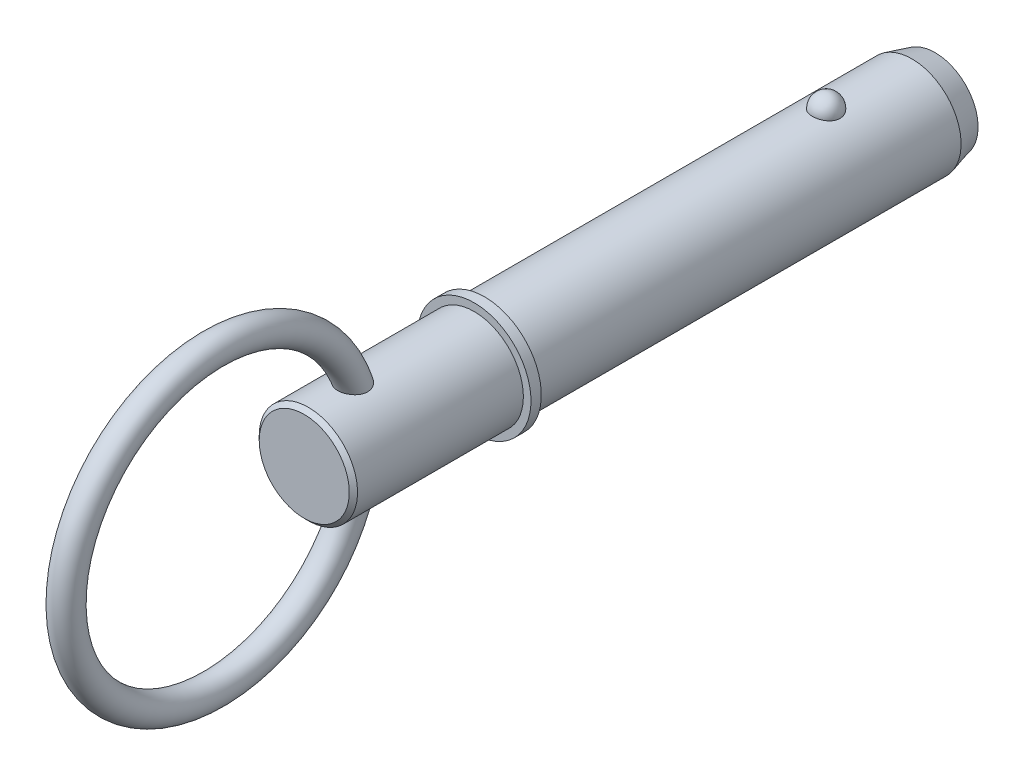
ISO-10303-21;
HEADER;
FILE_DESCRIPTION(('STEP AP214'),'2;1');
FILE_NAME('part.step','',(''),(''),'','','');
FILE_SCHEMA(('AUTOMOTIVE_DESIGN { 1 0 10303 214 1 1 1 1 }'));
ENDSEC;
DATA;
#1=APPLICATION_CONTEXT('core data for automotive mechanical design processes');
#2=APPLICATION_PROTOCOL_DEFINITION('international standard','automotive_design',2000,#1);
#3=PRODUCT_CONTEXT('',#1,'mechanical');
#4=PRODUCT('Part','Part','',(#3));
#5=PRODUCT_RELATED_PRODUCT_CATEGORY('part','',(#4));
#6=PRODUCT_DEFINITION_FORMATION('','',#4);
#7=PRODUCT_DEFINITION_CONTEXT('part definition',#1,'design');
#8=PRODUCT_DEFINITION('design','',#6,#7);
#9=PRODUCT_DEFINITION_SHAPE('','',#8);
#10=(LENGTH_UNIT() NAMED_UNIT(*) SI_UNIT(.MILLI.,.METRE.));
#11=(NAMED_UNIT(*) PLANE_ANGLE_UNIT() SI_UNIT($,.RADIAN.));
#12=(NAMED_UNIT(*) SI_UNIT($,.STERADIAN.) SOLID_ANGLE_UNIT());
#13=UNCERTAINTY_MEASURE_WITH_UNIT(LENGTH_MEASURE(1.E-05),#10,'distance_accuracy_value','');
#14=(GEOMETRIC_REPRESENTATION_CONTEXT(3) GLOBAL_UNCERTAINTY_ASSIGNED_CONTEXT((#13)) GLOBAL_UNIT_ASSIGNED_CONTEXT((#10,
#11,#12)) REPRESENTATION_CONTEXT('',''));
#15=CARTESIAN_POINT('',(0.,0.,0.));
#16=DIRECTION('',(0.,0.,1.));
#17=DIRECTION('',(1.,0.,0.));
#18=AXIS2_PLACEMENT_3D('',#15,#16,#17);
#19=CARTESIAN_POINT('',(0.,0.,63.5));
#20=DIRECTION('',(0.,0.,-1.));
#21=DIRECTION('',(-1.,0.,0.));
#22=AXIS2_PLACEMENT_3D('',#19,#20,#21);
#23=CYLINDRICAL_SURFACE('',#22,9.525);
#24=CARTESIAN_POINT('',(2.66304631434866,9.14515223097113,-2.69));
#25=CARTESIAN_POINT('',(2.66304388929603,9.14515434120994,-2.53964785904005));
#26=CARTESIAN_POINT('',(2.65079171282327,9.14874785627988,-2.389265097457));
#27=CARTESIAN_POINT('',(2.60207590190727,9.16272073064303,-2.09276319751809));
#28=CARTESIAN_POINT('',(2.5656035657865,9.17310252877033,-1.94664561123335));
#29=CARTESIAN_POINT('',(2.469373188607,9.19947238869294,-1.66290124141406));
#30=CARTESIAN_POINT('',(2.40962536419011,9.215457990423,-1.52527076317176));
#31=CARTESIAN_POINT('',(2.26832639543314,9.25124900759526,-1.26225231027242));
#32=CARTESIAN_POINT('',(2.1867756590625,9.27105435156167,-1.1368641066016));
#33=CARTESIAN_POINT('',(2.00344089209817,9.3123948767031,-0.901158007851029));
#34=CARTESIAN_POINT('',(1.90155748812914,9.33393823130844,-0.790918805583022));
#35=CARTESIAN_POINT('',(1.68043702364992,9.37626794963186,-0.589299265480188));
#36=CARTESIAN_POINT('',(1.56119995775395,9.397054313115,-0.497918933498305));
#37=CARTESIAN_POINT('',(1.30893044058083,9.43549335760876,-0.33681251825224));
#38=CARTESIAN_POINT('',(1.17593917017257,9.45315498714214,-0.267024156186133));
#39=CARTESIAN_POINT('',(0.8995966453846,9.48344056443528,-0.150749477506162));
#40=CARTESIAN_POINT('',(0.756246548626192,9.49606507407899,-0.104260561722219));
#41=CARTESIAN_POINT('',(0.466048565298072,9.51468193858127,-0.0365733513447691));
#42=CARTESIAN_POINT('',(0.319312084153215,9.52079100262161,-0.0149294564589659));
#43=CARTESIAN_POINT('',(0.0241592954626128,9.52611235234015,0.00395337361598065));
#44=CARTESIAN_POINT('',(-0.124256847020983,9.5253253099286,0.00119468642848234));
#45=CARTESIAN_POINT('',(-0.41628168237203,9.51700443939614,-0.0284230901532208));
#46=CARTESIAN_POINT('',(-0.559928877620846,9.50956858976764,-0.0549321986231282));
#47=CARTESIAN_POINT('',(-0.840604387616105,9.48887888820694,-0.130816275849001));
#48=CARTESIAN_POINT('',(-0.977632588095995,9.47562493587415,-0.180191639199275));
#49=CARTESIAN_POINT('',(-1.24212223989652,9.44460733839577,-0.300803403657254));
#50=CARTESIAN_POINT('',(-1.36952298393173,9.42681774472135,-0.372166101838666));
#51=CARTESIAN_POINT('',(-1.61053183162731,9.38864858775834,-0.53472901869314));
#52=CARTESIAN_POINT('',(-1.72413851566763,9.36826875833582,-0.625931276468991));
#53=CARTESIAN_POINT('',(-1.9367483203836,9.32666137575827,-0.827716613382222));
#54=CARTESIAN_POINT('',(-2.03542624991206,9.3054250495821,-0.93864062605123));
#55=CARTESIAN_POINT('',(-2.21301001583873,9.26480083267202,-1.17562728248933));
#56=CARTESIAN_POINT('',(-2.29191442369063,9.24541307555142,-1.30169101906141));
#57=CARTESIAN_POINT('',(-2.4288038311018,9.21040769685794,-1.56709947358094));
#58=CARTESIAN_POINT('',(-2.48653332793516,9.19483682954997,-1.7065822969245));
#59=CARTESIAN_POINT('',(-2.57830950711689,9.16952722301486,-1.9936348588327));
#60=CARTESIAN_POINT('',(-2.61235688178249,9.1597883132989,-2.14120436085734));
#61=CARTESIAN_POINT('',(-2.65582131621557,9.14728131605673,-2.43957517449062));
#62=CARTESIAN_POINT('',(-2.66534248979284,9.14448376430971,-2.59036007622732));
#63=CARTESIAN_POINT('',(-2.659816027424,9.1460926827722,-2.89143694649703));
#64=CARTESIAN_POINT('',(-2.64476907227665,9.15049895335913,-3.04172892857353));
#65=CARTESIAN_POINT('',(-2.59062526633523,9.16597303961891,-3.33676161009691));
#66=CARTESIAN_POINT('',(-2.55165119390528,9.17700684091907,-3.48152666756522));
#67=CARTESIAN_POINT('',(-2.45072334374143,9.20447158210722,-3.76226728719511));
#68=CARTESIAN_POINT('',(-2.38876863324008,9.22090274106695,-3.89824249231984));
#69=CARTESIAN_POINT('',(-2.24300082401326,9.25744165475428,-4.15838266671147));
#70=CARTESIAN_POINT('',(-2.15906901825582,9.27756919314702,-4.28247834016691));
#71=CARTESIAN_POINT('',(-1.97161008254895,9.31920445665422,-4.51460755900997));
#72=CARTESIAN_POINT('',(-1.86808218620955,9.34071223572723,-4.62264047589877));
#73=CARTESIAN_POINT('',(-1.64365852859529,9.38280712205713,-4.82005417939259));
#74=CARTESIAN_POINT('',(-1.52269814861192,9.40339041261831,-4.90936239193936));
#75=CARTESIAN_POINT('',(-1.26696810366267,9.44124442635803,-5.06628635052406));
#76=CARTESIAN_POINT('',(-1.13219941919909,9.45851538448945,-5.13390363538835));
#77=CARTESIAN_POINT('',(-0.854427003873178,9.48761400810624,-5.24478918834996));
#78=CARTESIAN_POINT('',(-0.711548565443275,9.49950757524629,-5.28835378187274));
#79=CARTESIAN_POINT('',(-0.420167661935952,9.51684639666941,-5.35116010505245));
#80=CARTESIAN_POINT('',(-0.271665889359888,9.52229244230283,-5.3704048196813));
#81=CARTESIAN_POINT('',(0.0236961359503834,9.52609381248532,-5.38387805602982));
#82=CARTESIAN_POINT('',(0.170533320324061,9.52458300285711,-5.37857884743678));
#83=CARTESIAN_POINT('',(0.461166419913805,9.51494050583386,-5.34419624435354));
#84=CARTESIAN_POINT('',(0.604962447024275,9.50680906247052,-5.31511372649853));
#85=CARTESIAN_POINT('',(0.884899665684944,9.48484202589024,-5.23415185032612));
#86=CARTESIAN_POINT('',(1.02106863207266,9.47102889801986,-5.18236222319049));
#87=CARTESIAN_POINT('',(1.28268503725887,9.43915933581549,-5.05742910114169));
#88=CARTESIAN_POINT('',(1.40813178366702,9.421102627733,-4.98428422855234));
#89=CARTESIAN_POINT('',(1.64690915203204,9.38233399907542,-4.81729201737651));
#90=CARTESIAN_POINT('',(1.76002050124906,9.36158508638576,-4.72313982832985));
#91=CARTESIAN_POINT('',(1.96897358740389,9.31987907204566,-4.5173244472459));
#92=CARTESIAN_POINT('',(2.06481234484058,9.29892193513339,-4.40565824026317));
#93=CARTESIAN_POINT('',(2.23837433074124,9.25869342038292,-4.16566572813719));
#94=CARTESIAN_POINT('',(2.31574652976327,9.23945848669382,-4.03707931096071));
#95=CARTESIAN_POINT('',(2.44818540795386,9.20525491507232,-3.76840633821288));
#96=CARTESIAN_POINT('',(2.50325979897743,9.19028480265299,-3.62832377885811));
#97=CARTESIAN_POINT('',(2.58510224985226,9.16757716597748,-3.35610038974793));
#98=CARTESIAN_POINT('',(2.61427951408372,9.15923447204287,-3.22472833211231));
#99=CARTESIAN_POINT('',(2.6532524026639,9.14802112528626,-2.95891229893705));
#100=CARTESIAN_POINT('',(2.66304848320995,9.1451503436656,-2.82446839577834));
#101=CARTESIAN_POINT('',(2.66304631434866,9.14515223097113,-2.69));
#102=B_SPLINE_CURVE_WITH_KNOTS('',3,(#24,#25,#26,#27,#28,#29,#30,#31,#32,#33,#34,#35,#36,#37,
#38,#39,#40,#41,#42,#43,#44,#45,#46,#47,#48,#49,#50,#51,#52,#53,#54,#55,#56,#57,#58,#59,#60,#61,
#62,#63,#64,#65,#66,#67,#68,#69,#70,#71,#72,#73,#74,#75,#76,#77,#78,#79,#80,#81,#82,#83,#84,#85,
#86,#87,#88,#89,#90,#91,#92,#93,#94,#95,#96,#97,#98,#99,#100,#101),.UNSPECIFIED.,.T.,.F.,(4,2,2,
2,2,2,2,2,2,2,2,2,2,2,2,2,2,2,2,2,2,2,2,2,2,2,2,2,2,2,2,2,2,2,2,2,2,2,4),(0.,0.450573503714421,
0.901308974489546,1.35184682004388,1.80237623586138,2.25516399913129,2.70795190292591,
3.15942136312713,3.61084044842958,4.0540301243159,4.49717661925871,4.9338984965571,
5.37062791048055,5.80991423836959,6.24924573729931,6.69708004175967,7.1449466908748,
7.5980522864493,8.0511446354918,8.50231041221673,8.95346368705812,9.40232106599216,
9.85119666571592,10.3025487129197,10.7539184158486,11.2070064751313,11.6600623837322,
12.1074045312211,12.5546917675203,12.9934085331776,13.4321091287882,13.8690915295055,
14.3061021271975,14.7499227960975,15.1938199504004,15.6455814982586,16.0971866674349,
16.5001694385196,16.9031427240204),.UNSPECIFIED.);
#103=CARTESIAN_POINT('',(2.66304631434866,9.14515223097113,-2.69));
#104=VERTEX_POINT('',#103);
#105=EDGE_CURVE('E103',#104,#104,#102,.T.);
#106=ORIENTED_EDGE('',*,*,#105,.T.);
#107=EDGE_LOOP('',(#106));
#108=FACE_BOUND('',#107,.T.);
#109=CARTESIAN_POINT('',(0.,0.,-19.3));
#110=DIRECTION('',(0.,0.,-1.));
#111=DIRECTION('',(-1.,0.,0.));
#112=AXIS2_PLACEMENT_3D('',#109,#110,#111);
#113=CIRCLE('',#112,9.525);
#114=CARTESIAN_POINT('',(-9.525,0.,-19.3));
#115=VERTEX_POINT('',#114);
#116=EDGE_CURVE('E110',#115,#115,#113,.F.);
#117=ORIENTED_EDGE('',*,*,#116,.T.);
#118=EDGE_LOOP('',(#117));
#119=FACE_BOUND('',#118,.T.);
#120=CARTESIAN_POINT('',(0.,0.,63.5));
#121=DIRECTION('',(0.,0.,1.));
#122=DIRECTION('',(1.,0.,0.));
#123=AXIS2_PLACEMENT_3D('',#120,#121,#122);
#124=CIRCLE('',#123,9.525);
#125=CARTESIAN_POINT('',(9.525,0.,63.5));
#126=VERTEX_POINT('',#125);
#127=EDGE_CURVE('E108',#126,#126,#124,.T.);
#128=ORIENTED_EDGE('',*,*,#127,.F.);
#129=EDGE_LOOP('',(#128));
#130=FACE_BOUND('',#129,.T.);
#131=ADVANCED_FACE('F39',(#108,#119,#130),#23,.T.);
#132=CARTESIAN_POINT('',(0.,0.,-23.8));
#133=DIRECTION('',(0.,0.,-1.));
#134=DIRECTION('',(-1.,0.,0.));
#135=AXIS2_PLACEMENT_3D('',#132,#133,#134);
#136=PLANE('',#135);
#137=CARTESIAN_POINT('',(0.,0.,-23.8));
#138=DIRECTION('',(0.,0.,-1.));
#139=DIRECTION('',(-1.,0.,0.));
#140=AXIS2_PLACEMENT_3D('',#137,#138,#139);
#141=CIRCLE('',#140,8.31922863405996);
#142=CARTESIAN_POINT('',(-8.31922863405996,0.,-23.8));
#143=VERTEX_POINT('',#142);
#144=EDGE_CURVE('E142',#143,#143,#141,.T.);
#145=ORIENTED_EDGE('',*,*,#144,.T.);
#146=EDGE_LOOP('',(#145));
#147=FACE_BOUND('',#146,.T.);
#148=ADVANCED_FACE('F89',(#147),#136,.T.);
#149=CARTESIAN_POINT('',(0.,0.,-23.8));
#150=DIRECTION('',(0.,0.,1.));
#151=DIRECTION('',(1.,0.,0.));
#152=AXIS2_PLACEMENT_3D('',#149,#150,#151);
#153=CONICAL_SURFACE('',#152,8.31922863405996,0.261799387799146);
#154=ORIENTED_EDGE('',*,*,#116,.F.);
#155=EDGE_LOOP('',(#154));
#156=FACE_BOUND('',#155,.T.);
#157=ORIENTED_EDGE('',*,*,#144,.F.);
#158=EDGE_LOOP('',(#157));
#159=FACE_BOUND('',#158,.T.);
#160=ADVANCED_FACE('F95',(#156,#159),#153,.T.);
#161=CARTESIAN_POINT('',(0.,9.525,-2.69));
#162=DIRECTION('',(0.,1.,0.));
#163=DIRECTION('',(0.,0.,1.));
#164=AXIS2_PLACEMENT_3D('',#161,#162,#163);
#165=SPHERICAL_SURFACE('',#164,2.69);
#166=ORIENTED_EDGE('',*,*,#105,.F.);
#167=EDGE_LOOP('',(#166));
#168=FACE_BOUND('',#167,.T.);
#169=ADVANCED_FACE('F113',(#168),#165,.T.);
#170=CARTESIAN_POINT('',(0.,0.,63.5));
#171=DIRECTION('',(0.,0.,-1.));
#172=DIRECTION('',(-1.,0.,0.));
#173=AXIS2_PLACEMENT_3D('',#170,#171,#172);
#174=PLANE('',#173);
#175=ORIENTED_EDGE('',*,*,#127,.T.);
#176=EDGE_LOOP('',(#175));
#177=FACE_BOUND('',#176,.T.);
#178=CARTESIAN_POINT('',(0.,0.,63.5));
#179=DIRECTION('',(0.,0.,-1.));
#180=DIRECTION('',(-1.,0.,0.));
#181=AXIS2_PLACEMENT_3D('',#178,#179,#180);
#182=CIRCLE('',#181,11.);
#183=CARTESIAN_POINT('',(-11.,0.,63.5));
#184=VERTEX_POINT('',#183);
#185=EDGE_CURVE('E109',#184,#184,#182,.T.);
#186=ORIENTED_EDGE('',*,*,#185,.T.);
#187=EDGE_LOOP('',(#186));
#188=FACE_BOUND('',#187,.T.);
#189=ADVANCED_FACE('F117',(#177,#188),#174,.T.);
#190=CARTESIAN_POINT('',(0.,0.,33.7287874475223));
#191=DIRECTION('',(0.,0.,-1.));
#192=DIRECTION('',(-1.,0.,0.));
#193=AXIS2_PLACEMENT_3D('',#190,#191,#192);
#194=CYLINDRICAL_SURFACE('',#193,11.);
#195=CARTESIAN_POINT('',(0.,0.,65.5));
#196=DIRECTION('',(0.,0.,-1.));
#197=DIRECTION('',(-1.,0.,0.));
#198=AXIS2_PLACEMENT_3D('',#195,#196,#197);
#199=CIRCLE('',#198,11.);
#200=CARTESIAN_POINT('',(-11.,0.,65.5));
#201=VERTEX_POINT('',#200);
#202=EDGE_CURVE('E134',#201,#201,#199,.T.);
#203=ORIENTED_EDGE('',*,*,#202,.T.);
#204=EDGE_LOOP('',(#203));
#205=FACE_BOUND('',#204,.T.);
#206=ORIENTED_EDGE('',*,*,#185,.F.);
#207=EDGE_LOOP('',(#206));
#208=FACE_BOUND('',#207,.T.);
#209=ADVANCED_FACE('F121',(#205,#208),#194,.T.);
#210=CARTESIAN_POINT('',(0.,11.,65.5));
#211=DIRECTION('',(0.,0.,1.));
#212=DIRECTION('',(1.,0.,0.));
#213=AXIS2_PLACEMENT_3D('',#210,#211,#212);
#214=PLANE('',#213);
#215=CARTESIAN_POINT('',(0.,0.,65.5));
#216=DIRECTION('',(0.,0.,1.));
#217=DIRECTION('',(1.,0.,0.));
#218=AXIS2_PLACEMENT_3D('',#215,#216,#217);
#219=CIRCLE('',#218,9.525);
#220=CARTESIAN_POINT('',(9.525,0.,65.5));
#221=VERTEX_POINT('',#220);
#222=EDGE_CURVE('E112',#221,#221,#219,.T.);
#223=ORIENTED_EDGE('',*,*,#222,.F.);
#224=EDGE_LOOP('',(#223));
#225=FACE_BOUND('',#224,.T.);
#226=ORIENTED_EDGE('',*,*,#202,.F.);
#227=EDGE_LOOP('',(#226));
#228=FACE_BOUND('',#227,.T.);
#229=ADVANCED_FACE('F86',(#225,#228),#214,.T.);
#230=CARTESIAN_POINT('',(0.,0.,98.43));
#231=DIRECTION('',(0.,0.,-1.));
#232=DIRECTION('',(-1.,0.,0.));
#233=AXIS2_PLACEMENT_3D('',#230,#231,#232);
#234=CYLINDRICAL_SURFACE('',#233,9.525);
#235=CARTESIAN_POINT('',(-1.17255022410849,-9.45255262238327,86.4156813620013));
#236=CARTESIAN_POINT('',(-1.03279041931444,-9.46988901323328,86.3520581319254));
#237=CARTESIAN_POINT('',(-0.887457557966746,-9.48474288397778,86.3000360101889));
#238=CARTESIAN_POINT('',(-0.589790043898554,-9.50789357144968,86.2203017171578));
#239=CARTESIAN_POINT('',(-0.437456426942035,-9.51619135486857,86.1925859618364));
#240=CARTESIAN_POINT('',(-0.13009534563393,-9.52535230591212,86.162037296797));
#241=CARTESIAN_POINT('',(0.0249321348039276,-9.52621542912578,86.1592045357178));
#242=CARTESIAN_POINT('',(0.333291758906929,-9.5204161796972,86.1784804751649));
#243=CARTESIAN_POINT('',(0.48662384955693,-9.51375357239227,86.2005899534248));
#244=CARTESIAN_POINT('',(0.787326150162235,-9.49360162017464,86.2693091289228));
#245=CARTESIAN_POINT('',(0.934692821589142,-9.48010828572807,86.3159331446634));
#246=CARTESIAN_POINT('',(1.2191706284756,-9.44773819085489,86.432695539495));
#247=CARTESIAN_POINT('',(1.35628163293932,-9.42886136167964,86.5028342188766));
#248=CARTESIAN_POINT('',(1.61597534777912,-9.38783836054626,86.6648586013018));
#249=CARTESIAN_POINT('',(1.73859309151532,-9.36570037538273,86.7566901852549));
#250=CARTESIAN_POINT('',(1.96611924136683,-9.32059424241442,86.9599834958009));
#251=CARTESIAN_POINT('',(2.07103000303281,-9.29762620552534,87.0714426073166));
#252=CARTESIAN_POINT('',(2.25895856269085,-9.25375378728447,87.309567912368));
#253=CARTESIAN_POINT('',(2.34223089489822,-9.23282741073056,87.4360291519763));
#254=CARTESIAN_POINT('',(2.48638570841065,-9.19505802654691,87.7016544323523));
#255=CARTESIAN_POINT('',(2.54727152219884,-9.17821441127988,87.8408165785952));
#256=CARTESIAN_POINT('',(2.64504150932,-9.15051673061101,88.1264509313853));
#257=CARTESIAN_POINT('',(2.68213620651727,-9.13961026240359,88.27284631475));
#258=CARTESIAN_POINT('',(2.73308631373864,-9.1245038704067,88.5699359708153));
#259=CARTESIAN_POINT('',(2.74693762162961,-9.12030513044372,88.7206309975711));
#260=CARTESIAN_POINT('',(2.75225289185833,-9.11870262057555,89.0282041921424));
#261=CARTESIAN_POINT('',(2.742835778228,-9.12156626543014,89.1850973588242));
#262=CARTESIAN_POINT('',(2.70120500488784,-9.13397864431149,89.4955303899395));
#263=CARTESIAN_POINT('',(2.66898313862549,-9.14352978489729,89.6490690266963));
#264=CARTESIAN_POINT('',(2.57915721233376,-9.1692947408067,89.9643171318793));
#265=CARTESIAN_POINT('',(2.5193838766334,-9.18606757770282,90.1253627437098));
#266=CARTESIAN_POINT('',(2.37615490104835,-9.22415241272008,90.4361129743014));
#267=CARTESIAN_POINT('',(2.29267648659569,-9.2454687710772,90.5858065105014));
#268=CARTESIAN_POINT('',(2.09570343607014,-9.29218719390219,90.8820058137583));
#269=CARTESIAN_POINT('',(1.98029238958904,-9.31778152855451,91.0272155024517));
#270=CARTESIAN_POINT('',(1.72523060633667,-9.36835235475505,91.294631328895));
#271=CARTESIAN_POINT('',(1.58560973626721,-9.39332956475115,91.4168654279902));
#272=CARTESIAN_POINT('',(1.31999418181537,-9.4338116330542,91.606542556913));
#273=CARTESIAN_POINT('',(1.1984987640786,-9.45016352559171,91.6801115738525));
#274=CARTESIAN_POINT('',(0.944726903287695,-9.47889043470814,91.8065550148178));
#275=CARTESIAN_POINT('',(0.812460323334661,-9.4912690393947,91.8594481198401));
#276=CARTESIAN_POINT('',(0.53938567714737,-9.51070487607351,91.9415791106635));
#277=CARTESIAN_POINT('',(0.398529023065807,-9.51772807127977,91.970665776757));
#278=CARTESIAN_POINT('',(0.113692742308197,-9.52538430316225,92.0023462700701));
#279=CARTESIAN_POINT('',(-0.0302854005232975,-9.52602031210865,92.0049524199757));
#280=CARTESIAN_POINT('',(-0.301067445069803,-9.52110324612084,91.9846387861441));
#281=CARTESIAN_POINT('',(-0.42809194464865,-9.51619084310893,91.9643615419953));
#282=CARTESIAN_POINT('',(-0.676960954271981,-9.50173118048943,91.9037701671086));
#283=CARTESIAN_POINT('',(-0.798804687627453,-9.49218322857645,91.8634530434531));
#284=CARTESIAN_POINT('',(-1.03743276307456,-9.4691126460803,91.7637974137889));
#285=CARTESIAN_POINT('',(-1.15402581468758,-9.45550022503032,91.7040261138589));
#286=CARTESIAN_POINT('',(-1.37707059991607,-9.42560278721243,91.5684655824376));
#287=CARTESIAN_POINT('',(-1.48351822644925,-9.40931669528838,91.4926699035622));
#288=CARTESIAN_POINT('',(-1.70022776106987,-9.37276249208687,91.3152067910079));
#289=CARTESIAN_POINT('',(-1.80866644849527,-9.35226352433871,91.2113639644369));
#290=CARTESIAN_POINT('',(-2.00947431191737,-9.31118474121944,90.9891646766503));
#291=CARTESIAN_POINT('',(-2.10183201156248,-9.29060487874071,90.870797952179));
#292=CARTESIAN_POINT('',(-2.28343646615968,-9.24779116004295,90.6017233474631));
#293=CARTESIAN_POINT('',(-2.36963977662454,-9.22584708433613,90.4489048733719));
#294=CARTESIAN_POINT('',(-2.51731958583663,-9.18665215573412,90.1311082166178));
#295=CARTESIAN_POINT('',(-2.57878214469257,-9.16940395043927,89.9661232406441));
#296=CARTESIAN_POINT('',(-2.67771284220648,-9.14102404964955,89.6179062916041));
#297=CARTESIAN_POINT('',(-2.71355979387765,-9.13031106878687,89.4341717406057));
#298=CARTESIAN_POINT('',(-2.75239325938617,-9.11868499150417,89.0629391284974));
#299=CARTESIAN_POINT('',(-2.75540326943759,-9.11776488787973,88.8754438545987));
#300=CARTESIAN_POINT('',(-2.72755769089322,-9.12612848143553,88.5182334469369));
#301=CARTESIAN_POINT('',(-2.69938579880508,-9.1346036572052,88.3482935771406));
#302=CARTESIAN_POINT('',(-2.6128234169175,-9.15973790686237,88.0169419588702));
#303=CARTESIAN_POINT('',(-2.5544530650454,-9.17639152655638,87.8555246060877));
#304=CARTESIAN_POINT('',(-2.41575064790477,-9.21381352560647,87.5622621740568));
#305=CARTESIAN_POINT('',(-2.33810564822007,-9.23402440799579,87.4290677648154));
#306=CARTESIAN_POINT('',(-2.16110598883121,-9.27704240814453,87.1784363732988));
#307=CARTESIAN_POINT('',(-2.06174995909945,-9.29984968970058,87.06100038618));
#308=CARTESIAN_POINT('',(-1.84046167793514,-9.34620233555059,86.8414448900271));
#309=CARTESIAN_POINT('',(-1.71787459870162,-9.36974632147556,86.7399849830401));
#310=CARTESIAN_POINT('',(-1.45637301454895,-9.41393415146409,86.5600854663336));
#311=CARTESIAN_POINT('',(-1.31745717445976,-9.43457775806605,86.4816477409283));
#312=CARTESIAN_POINT('',(-1.17255022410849,-9.45255262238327,86.4156813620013));
#313=B_SPLINE_CURVE_WITH_KNOTS('',3,(#235,#236,#237,#238,#239,#240,#241,#242,#243,#244,#245,
#246,#247,#248,#249,#250,#251,#252,#253,#254,#255,#256,#257,#258,#259,#260,#261,#262,#263,#264,
#265,#266,#267,#268,#269,#270,#271,#272,#273,#274,#275,#276,#277,#278,#279,#280,#281,#282,#283,
#284,#285,#286,#287,#288,#289,#290,#291,#292,#293,#294,#295,#296,#297,#298,#299,#300,#301,#302,
#303,#304,#305,#306,#307,#308,#309,#310,#311,#312),.UNSPECIFIED.,.T.,.F.,(4,2,2,2,2,2,2,2,2,2,2,
2,2,2,2,2,2,2,2,2,2,2,2,2,2,2,2,2,2,2,2,2,2,2,2,2,2,2,4),(0.,0.463035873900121,
0.926003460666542,1.38897381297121,1.85195860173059,2.31521411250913,2.77847553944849,
3.24059321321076,3.70264936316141,4.15899535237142,4.61527338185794,5.06745604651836,
5.51971850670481,5.98936669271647,6.45918397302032,6.9748286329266,7.49097038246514,
8.04995658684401,8.60825803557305,9.03545685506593,9.46226879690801,9.89177127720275,
10.3210738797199,10.7054535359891,11.0898906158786,11.4835430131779,11.8773540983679,
12.3302409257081,12.7834496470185,13.311649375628,13.8401462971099,14.3996817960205,
14.9588168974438,15.4733264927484,15.9874934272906,16.451669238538,16.915874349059,
17.3959238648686,17.8760126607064),.UNSPECIFIED.);
#314=CARTESIAN_POINT('',(-1.17255022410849,-9.45255262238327,86.4156813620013));
#315=VERTEX_POINT('',#314);
#316=EDGE_CURVE('E10',#315,#315,#313,.T.);
#317=ORIENTED_EDGE('',*,*,#316,.F.);
#318=EDGE_LOOP('',(#317));
#319=FACE_BOUND('',#318,.T.);
#320=CARTESIAN_POINT('',(-1.17255022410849,9.45255262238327,86.4156813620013));
#321=CARTESIAN_POINT('',(-1.31058061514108,9.43543238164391,86.4785143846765));
#322=CARTESIAN_POINT('',(-1.44315063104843,9.41589375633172,86.5526513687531));
#323=CARTESIAN_POINT('',(-1.69365345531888,9.37407591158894,86.7218923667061));
#324=CARTESIAN_POINT('',(-1.81158925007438,9.35179725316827,86.8169920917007));
#325=CARTESIAN_POINT('',(-2.02956633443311,9.30692788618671,87.0259676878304));
#326=CARTESIAN_POINT('',(-2.12959463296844,9.28433696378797,87.1398570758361));
#327=CARTESIAN_POINT('',(-2.30883055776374,9.24139869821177,87.3833457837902));
#328=CARTESIAN_POINT('',(-2.38804080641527,9.22105107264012,87.5129431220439));
#329=CARTESIAN_POINT('',(-2.52289811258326,9.18506690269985,87.7826371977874));
#330=CARTESIAN_POINT('',(-2.57879510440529,9.16938093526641,87.9226025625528));
#331=CARTESIAN_POINT('',(-2.66732862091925,9.14402087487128,88.2101942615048));
#332=CARTESIAN_POINT('',(-2.6999643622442,9.13434698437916,88.3578208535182));
#333=CARTESIAN_POINT('',(-2.74234854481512,9.12171311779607,88.6587097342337));
#334=CARTESIAN_POINT('',(-2.75176419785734,9.11885078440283,88.8120223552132));
#335=CARTESIAN_POINT('',(-2.74768995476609,9.12007747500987,89.118282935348));
#336=CARTESIAN_POINT('',(-2.73419331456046,9.12416854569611,89.2712307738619));
#337=CARTESIAN_POINT('',(-2.6838140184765,9.13911977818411,89.5850489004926));
#338=CARTESIAN_POINT('',(-2.64520186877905,9.15047943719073,89.7456159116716));
#339=CARTESIAN_POINT('',(-2.54485320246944,9.17889121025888,90.0588781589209));
#340=CARTESIAN_POINT('',(-2.48309922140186,9.19594762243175,90.2115673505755));
#341=CARTESIAN_POINT('',(-2.33056913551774,9.23584987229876,90.5211220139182));
#342=CARTESIAN_POINT('',(-2.23745101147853,9.25911216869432,90.6767845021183));
#343=CARTESIAN_POINT('',(-2.02674425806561,9.30750138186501,90.9702795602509));
#344=CARTESIAN_POINT('',(-1.90916388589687,9.33262766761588,91.1081181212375));
#345=CARTESIAN_POINT('',(-1.67044606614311,9.37804498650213,91.3420159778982));
#346=CARTESIAN_POINT('',(-1.55243875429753,9.39849934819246,91.4412400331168));
#347=CARTESIAN_POINT('',(-1.30125310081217,9.43654625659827,91.6191930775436));
#348=CARTESIAN_POINT('',(-1.16808326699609,9.45414039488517,91.6979334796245));
#349=CARTESIAN_POINT('',(-0.958516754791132,9.47691412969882,91.797606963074));
#350=CARTESIAN_POINT('',(-0.886649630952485,9.48392776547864,91.8278606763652));
#351=CARTESIAN_POINT('',(-0.740281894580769,9.49647248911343,91.881484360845));
#352=CARTESIAN_POINT('',(-0.665782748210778,9.50200438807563,91.9048580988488));
#353=CARTESIAN_POINT('',(-0.514804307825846,9.51137811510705,91.9442294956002));
#354=CARTESIAN_POINT('',(-0.438326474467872,9.51522115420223,91.960232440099));
#355=CARTESIAN_POINT('',(-0.284116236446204,9.52107513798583,91.9845321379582));
#356=CARTESIAN_POINT('',(-0.206384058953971,9.52308641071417,91.9928302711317));
#357=CARTESIAN_POINT('',(0.0046395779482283,9.5259225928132,92.0045451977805));
#358=CARTESIAN_POINT('',(0.138460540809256,9.52491109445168,92.0003947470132));
#359=CARTESIAN_POINT('',(0.403152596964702,9.51738801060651,91.9692519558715));
#360=CARTESIAN_POINT('',(0.534023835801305,9.51087669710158,91.942260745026));
#361=CARTESIAN_POINT('',(0.783985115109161,9.49347484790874,91.8688065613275));
#362=CARTESIAN_POINT('',(0.903337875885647,9.48277338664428,91.8231810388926));
#363=CARTESIAN_POINT('',(1.13363663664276,9.45800893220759,91.7149289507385));
#364=CARTESIAN_POINT('',(1.24458027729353,9.44394500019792,91.6522976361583));
#365=CARTESIAN_POINT('',(1.46880911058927,9.41182796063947,91.504389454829));
#366=CARTESIAN_POINT('',(1.58087386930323,9.3935013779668,91.4173287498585));
#367=CARTESIAN_POINT('',(1.79132420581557,9.35565274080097,91.2282478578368));
#368=CARTESIAN_POINT('',(1.88970126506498,9.33612995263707,91.1262184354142));
#369=CARTESIAN_POINT('',(2.08778125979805,9.29401761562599,90.8909975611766));
#370=CARTESIAN_POINT('',(2.18473298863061,9.27148591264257,90.75547341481));
#371=CARTESIAN_POINT('',(2.35733954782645,9.22911075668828,90.4710303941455));
#372=CARTESIAN_POINT('',(2.43297838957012,9.2092693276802,90.3221015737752));
#373=CARTESIAN_POINT('',(2.56843139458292,9.17247322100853,89.9972697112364));
#374=CARTESIAN_POINT('',(2.62561924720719,9.15606955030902,89.8201963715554));
#375=CARTESIAN_POINT('',(2.70930664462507,9.13166037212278,89.458330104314));
#376=CARTESIAN_POINT('',(2.73581406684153,9.12365270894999,89.2735391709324));
#377=CARTESIAN_POINT('',(2.7551261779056,9.11784049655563,88.9090170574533));
#378=CARTESIAN_POINT('',(2.74917791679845,9.11965839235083,88.7293617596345));
#379=CARTESIAN_POINT('',(2.70473277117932,9.13294027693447,88.3744999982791));
#380=CARTESIAN_POINT('',(2.66626406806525,9.14439591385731,88.1992898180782));
#381=CARTESIAN_POINT('',(2.5626384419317,9.17393184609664,87.8784698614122));
#382=CARTESIAN_POINT('',(2.50080069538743,9.19116614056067,87.7317041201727));
#383=CARTESIAN_POINT('',(2.35244847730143,9.23024728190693,87.4518999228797));
#384=CARTESIAN_POINT('',(2.26593972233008,9.25209305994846,87.3188582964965));
#385=CARTESIAN_POINT('',(2.07585352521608,9.29652853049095,87.077145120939));
#386=CARTESIAN_POINT('',(1.97340753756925,9.31901931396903,86.9675620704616));
#387=CARTESIAN_POINT('',(1.75142335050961,9.3632753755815,86.7671794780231));
#388=CARTESIAN_POINT('',(1.63188535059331,9.38504066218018,86.6763797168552));
#389=CARTESIAN_POINT('',(1.3782626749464,9.42563474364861,86.5151683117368));
#390=CARTESIAN_POINT('',(1.24409194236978,9.44444438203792,86.4448873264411));
#391=CARTESIAN_POINT('',(0.965562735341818,9.47697010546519,86.3269968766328));
#392=CARTESIAN_POINT('',(0.821203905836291,9.4906860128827,86.2793882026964));
#393=CARTESIAN_POINT('',(0.524366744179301,9.51173338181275,86.2073692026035));
#394=CARTESIAN_POINT('',(0.37180751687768,9.5189799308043,86.1832670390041));
#395=CARTESIAN_POINT('',(0.0646112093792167,9.52602042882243,86.1598425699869));
#396=CARTESIAN_POINT('',(-0.090026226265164,9.52581308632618,86.1605245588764));
#397=CARTESIAN_POINT('',(-0.40413981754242,9.51777767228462,86.1872769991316));
#398=CARTESIAN_POINT('',(-0.563508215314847,9.50959696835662,86.2145222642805));
#399=CARTESIAN_POINT('',(-0.874799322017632,9.48602809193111,86.2955333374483));
#400=CARTESIAN_POINT('',(-1.02672214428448,9.47064002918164,86.3492987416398));
#401=CARTESIAN_POINT('',(-1.17255022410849,9.45255262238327,86.4156813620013));
#402=B_SPLINE_CURVE_WITH_KNOTS('',3,(#320,#321,#322,#323,#324,#325,#326,#327,#328,#329,#330,
#331,#332,#333,#334,#335,#336,#337,#338,#339,#340,#341,#342,#343,#344,#345,#346,#347,#348,#349,
#350,#351,#352,#353,#354,#355,#356,#357,#358,#359,#360,#361,#362,#363,#364,#365,#366,#367,#368,
#369,#370,#371,#372,#373,#374,#375,#376,#377,#378,#379,#380,#381,#382,#383,#384,#385,#386,#387,
#388,#389,#390,#391,#392,#393,#394,#395,#396,#397,#398,#399,#400,#401),.UNSPECIFIED.,.T.,.F.,(4,
2,2,2,2,2,2,2,2,2,2,2,2,2,2,2,2,2,2,2,2,2,2,2,2,2,2,2,2,2,2,2,2,2,2,2,2,2,2,2,4),(0.,
0.457306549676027,0.914519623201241,1.372063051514,1.82954881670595,2.28199545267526,
2.73445732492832,3.19336710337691,3.65241198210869,4.14699278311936,4.64194758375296,
5.18812269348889,5.73411374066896,6.19889752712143,6.66342179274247,6.89799214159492,
7.13243382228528,7.36670711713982,7.60093844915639,8.00032434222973,8.39969048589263,
8.78279802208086,9.16601265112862,9.5936670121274,10.0215863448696,10.5240084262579,
11.0268064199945,11.5844522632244,12.1419548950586,12.678191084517,13.2139630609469,
13.6920531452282,14.1700325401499,14.6229745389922,15.0759112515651,15.5316722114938,
15.9874490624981,16.4491237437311,16.9108784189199,17.3940267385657,17.8771677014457),.UNSPECIFIED.);
#403=CARTESIAN_POINT('',(-1.17255022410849,9.45255262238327,86.4156813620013));
#404=VERTEX_POINT('',#403);
#405=EDGE_CURVE('E51',#404,#404,#402,.T.);
#406=ORIENTED_EDGE('',*,*,#405,.F.);
#407=EDGE_LOOP('',(#406));
#408=FACE_BOUND('',#407,.T.);
#409=CARTESIAN_POINT('',(0.,0.,97.63));
#410=DIRECTION('',(0.,0.,-1.));
#411=DIRECTION('',(-1.,0.,0.));
#412=AXIS2_PLACEMENT_3D('',#409,#410,#411);
#413=CIRCLE('',#412,9.525);
#414=CARTESIAN_POINT('',(-9.525,0.,97.63));
#415=VERTEX_POINT('',#414);
#416=EDGE_CURVE('E65',#415,#415,#413,.T.);
#417=ORIENTED_EDGE('',*,*,#416,.T.);
#418=EDGE_LOOP('',(#417));
#419=FACE_BOUND('',#418,.T.);
#420=ORIENTED_EDGE('',*,*,#222,.T.);
#421=EDGE_LOOP('',(#420));
#422=FACE_BOUND('',#421,.T.);
#423=ADVANCED_FACE('F70',(#319,#408,#419,#422),#234,.T.);
#424=CARTESIAN_POINT('',(0.,0.,98.43));
#425=DIRECTION('',(0.,0.,-1.));
#426=DIRECTION('',(-1.,0.,0.));
#427=AXIS2_PLACEMENT_3D('',#424,#425,#426);
#428=PLANE('',#427);
#429=CARTESIAN_POINT('',(0.,0.,98.43));
#430=DIRECTION('',(0.,0.,-1.));
#431=DIRECTION('',(-1.,0.,0.));
#432=AXIS2_PLACEMENT_3D('',#429,#430,#431);
#433=CIRCLE('',#432,8.725);
#434=CARTESIAN_POINT('',(-8.725,0.,98.43));
#435=VERTEX_POINT('',#434);
#436=EDGE_CURVE('E58',#435,#435,#433,.F.);
#437=ORIENTED_EDGE('',*,*,#436,.T.);
#438=EDGE_LOOP('',(#437));
#439=FACE_BOUND('',#438,.T.);
#440=ADVANCED_FACE('F77',(#439),#428,.F.);
#441=CARTESIAN_POINT('',(0.,0.,97.63));
#442=DIRECTION('',(0.,0.,-1.));
#443=DIRECTION('',(-1.,0.,0.));
#444=AXIS2_PLACEMENT_3D('',#441,#442,#443);
#445=CONICAL_SURFACE('',#444,9.525,0.785398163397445);
#446=ORIENTED_EDGE('',*,*,#436,.F.);
#447=EDGE_LOOP('',(#446));
#448=FACE_BOUND('',#447,.T.);
#449=ORIENTED_EDGE('',*,*,#416,.F.);
#450=EDGE_LOOP('',(#449));
#451=FACE_BOUND('',#450,.T.);
#452=ADVANCED_FACE('F41',(#448,#451),#445,.T.);
#453=CARTESIAN_POINT('',(0.,0.,116.005));
#454=DIRECTION('',(1.,0.,0.));
#455=DIRECTION('',(0.,0.,-1.));
#456=AXIS2_PLACEMENT_3D('',#453,#454,#455);
#457=TOROIDAL_SURFACE('',#456,28.575,2.75);
#458=ORIENTED_EDGE('',*,*,#316,.T.);
#459=EDGE_LOOP('',(#458));
#460=FACE_BOUND('',#459,.T.);
#461=ORIENTED_EDGE('',*,*,#405,.T.);
#462=EDGE_LOOP('',(#461));
#463=FACE_BOUND('',#462,.T.);
#464=ADVANCED_FACE('F74',(#460,#463),#457,.T.);
#465=CLOSED_SHELL('',(#131,#148,#160,#169,#189,#209,#229,#423,#440,#452,#464));
#466=MANIFOLD_SOLID_BREP('B2',#465);
#467=ADVANCED_BREP_SHAPE_REPRESENTATION('',(#18,#466),#14);
#468=SHAPE_DEFINITION_REPRESENTATION(#9,#467);
ENDSEC;
END-ISO-10303-21;
